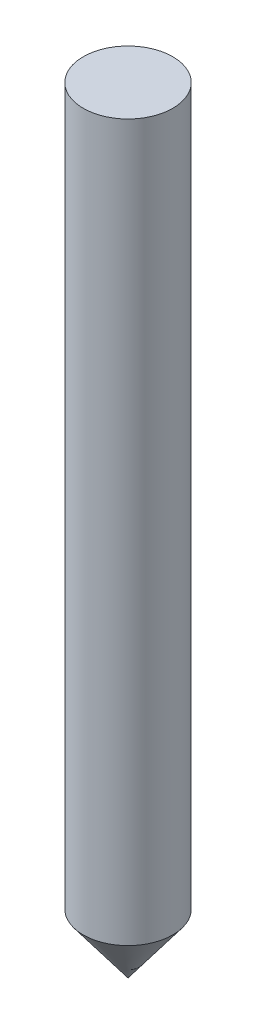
from build123d import *


with BuildPart() as part:
    # Croquis1 → Revoluci_n1 (revolve)
    with BuildSketch(Plane.XY, mode=Mode.PRIVATE) as revoluci_n1_sk:
        Polygon((0, 130), (-7.5, 130), (-7.5, 10), (0, 0), align=None)
    revolve(revoluci_n1_sk.sketch.rotate(Axis((0, 0, 0), (0, 1, 0)), 270), axis=Axis((0, 0, 0), (0, 1, 0)))


solid = part.part
